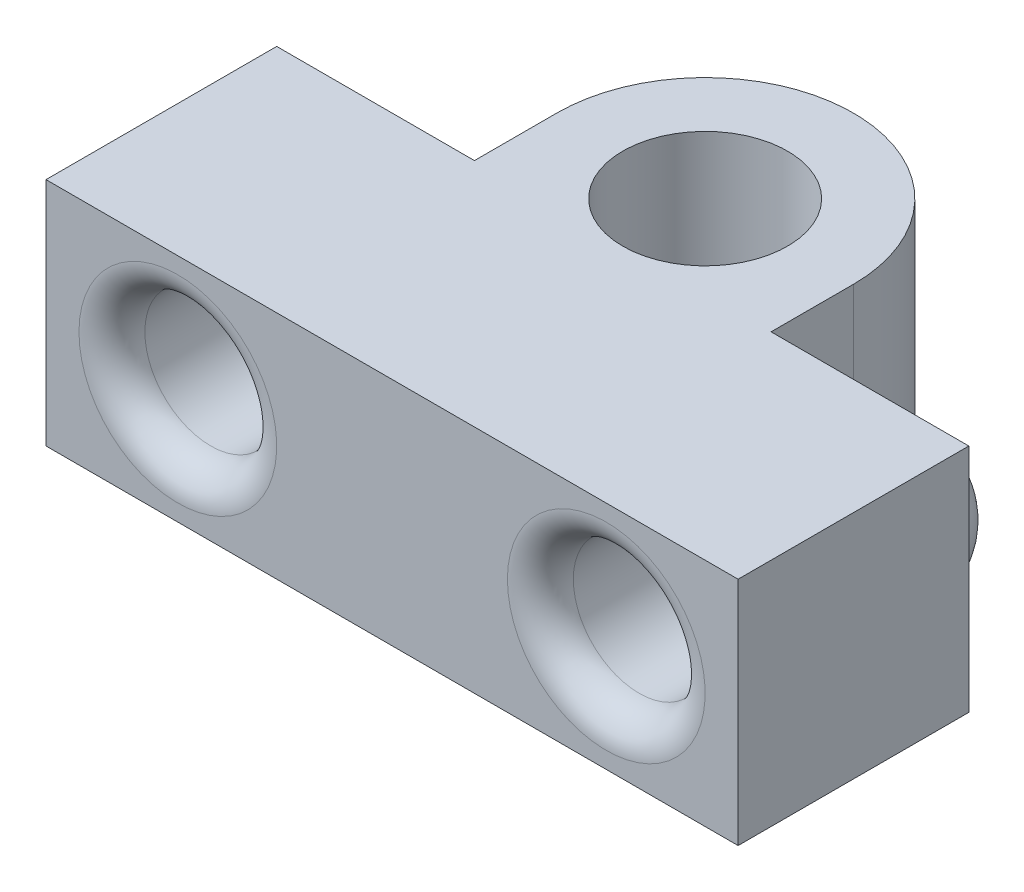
from build123d import *

# Parameters (mm, degrees)
AUFSATZ_LINEAR_AUSTRAGEN1_DEPTH = 7
SKIZZE3_R                       = 2
SCHNITT_LINEAR_AUSTRAGEN1_DEPTH = 6.7
VERRUNDUNG1_R                   = 1
SKIZZE4_R                       = 2.25
AUFSATZ_LINEAR_AUSTRAGEN2_DEPTH = 0.1
KUPPEL1_FACE_RADIUS             = 2.25
KUPPEL1_HEIGHT                  = 2.25
KUPPEL2_FACE_RADIUS             = 2.25
KUPPEL2_HEIGHT                  = 2.25


with BuildPart() as part:
    # Skizze1 → Aufsatz-Linear austragen1 (new body)
    with BuildSketch(Plane(origin=(0, 0, 0), x_dir=(1, 0, 0), z_dir=(0, 1, 0))):
        with BuildLine():
            ThreePointArc((-4.5, 2.5), (-4.30624304, 1.19375696), (-3.741657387, 0))
            Line((-3.741657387, 0), (-1e-09, 0))
            ThreePointArc((-1e-09, 0), (-2.5, 2.500000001), (0, 5))
            Line((0, 5), (0, 7))
            ThreePointArc((0, 7), (-3.181980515, 5.681980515), (-4.5, 2.5))
        make_face()
        with BuildLine():
            ThreePointArc((2.5, 2.5), (1.767766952, 0.732233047), (-1e-09, 0))
            Line((-1e-09, 0), (3.741657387, 0))
            ThreePointArc((3.741657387, 0), (4.30624304, 1.19375696), (4.5, 2.5))
            ThreePointArc((4.5, 2.5), (3.181980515, 5.681980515), (0, 7))
            Line((0, 7), (0, 5))
            ThreePointArc((0, 5), (1.767766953, 4.267766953), (2.5, 2.5))
        make_face()
        with BuildLine():
            ThreePointArc((-4.5, 2.5), (-4.30624304, 1.19375696), (-3.741657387, 0))
            Line((-3.741657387, 0), (-1e-09, 0))
            ThreePointArc((-1e-09, 0), (-2.5, 2.500000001), (0, 5))
            Line((0, 5), (0, 7))
            ThreePointArc((0, 7), (-3.181980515, 5.681980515), (-4.5, 2.5))
        make_face()
        with BuildLine():
            ThreePointArc((2.5, 2.5), (1.767766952, 0.732233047), (-1e-09, 0))
            Line((-1e-09, 0), (3.741657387, 0))
            ThreePointArc((3.741657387, 0), (4.30624304, 1.19375696), (4.5, 2.5))
            ThreePointArc((4.5, 2.5), (3.181980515, 5.681980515), (0, 7))
            Line((0, 7), (0, 5))
            ThreePointArc((0, 5), (1.767766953, 4.267766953), (2.5, 2.5))
        make_face()
        with BuildLine():
            Line((-4.5, 2.5), (-4.5, 0))
            Line((-4.5, 0), (-3.741657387, 0))
            ThreePointArc((-3.741657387, 0), (-4.30624304, 1.19375696), (-4.5, 2.5))
        make_face()
        with BuildLine():
            ThreePointArc((4.5, 2.5), (4.30624304, 1.19375696), (3.741657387, 0))
            Line((3.741657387, 0), (4.5, 0))
            Line((4.5, 0), (4.5, 2.5))
        make_face()
        with BuildLine():
            Line((-1e-09, 0), (-3.741657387, 0))
            ThreePointArc((-3.741657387, 0), (-2.121320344, -1.468626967), (0, -2))
            Line((0, -2), (0, 0))
        make_face()
        with BuildLine():
            Line((3.741657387, 0), (-1e-09, 0))
            Line((0, 0), (0, -2))
            ThreePointArc((0, -2), (2.121320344, -1.468626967), (3.741657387, 0))
        make_face()
        with BuildLine():
            Line((-1e-09, 0), (-3.741657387, 0))
            ThreePointArc((-3.741657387, 0), (-2.121320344, -1.468626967), (0, -2))
            Line((0, -2), (0, 0))
        make_face()
        with BuildLine():
            Line((3.741657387, 0), (-1e-09, 0))
            Line((0, 0), (0, -2))
            ThreePointArc((0, -2), (2.121320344, -1.468626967), (3.741657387, 0))
        make_face()
        with BuildLine():
            Line((-4.5, 0), (-10.5, 0))
            Line((-10.5, 0), (-10.5, -7))
            Line((-10.5, -7), (0, -7))
            Line((0, -7), (0, -2))
            ThreePointArc((0, -2), (-2.121320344, -1.468626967), (-3.741657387, 0))
            Line((-3.741657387, 0), (-4.5, 0))
        make_face()
        with BuildLine():
            Line((0, -2), (0, -7))
            Line((0, -7), (10.5, -7))
            Line((10.5, -7), (10.5, 0))
            Line((10.5, 0), (4.5, 0))
            Line((4.5, 0), (3.741657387, 0))
            ThreePointArc((3.741657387, 0), (2.121320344, -1.468626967), (0, -2))
        make_face()
    extrude(amount=AUFSATZ_LINEAR_AUSTRAGEN1_DEPTH)

    # Skizze3 → Schnitt-Linear austragen1 (cut)
    with BuildSketch(Plane.XY.offset(7)):
        with Locations((-6.5, 3.5)):
            Circle(SKIZZE3_R)
        with Locations((6.5, 3.5)):
            Circle(SKIZZE3_R)
    extrude(amount=-SCHNITT_LINEAR_AUSTRAGEN1_DEPTH, mode=Mode.SUBTRACT)

    # Verrundung1
    verrundung1_edges = [part.edges().sort_by_distance(p)[0] for p in [
        (-8.5, 3.5, 7),
        (4.5, 3.5, 7),
    ]]
    fillet(verrundung1_edges, radius=VERRUNDUNG1_R)

    # Skizze4 → Aufsatz-Linear austragen2 (add)
    with BuildSketch(Plane(origin=(0, 0, 0), x_dir=(-1, 0, 0), z_dir=(0, 0, -1))):
        with Locations((7.5, 3.5)):
            Circle(SKIZZE4_R)
        with Locations((-7.5, 3.5)):
            Circle(SKIZZE4_R)
    extrude(amount=AUFSATZ_LINEAR_AUSTRAGEN2_DEPTH)

    # Kuppel1: a dome of height H over a round flat face of radius A is a cap of a sphere of radius (A * A + H * H) / (2 * H)
    kuppel1_r = (KUPPEL1_FACE_RADIUS * KUPPEL1_FACE_RADIUS + KUPPEL1_HEIGHT * KUPPEL1_HEIGHT) / (2 * KUPPEL1_HEIGHT)
    kuppel1_base = Plane((7.5, 3.5, -0.1), z_dir=(0, 0, -1))
    with Locations(kuppel1_base.offset(KUPPEL1_HEIGHT - kuppel1_r)):
        kuppel1_ball = Sphere(kuppel1_r, mode=Mode.PRIVATE)
    add(split(kuppel1_ball, bisect_by=kuppel1_base, keep=Keep.TOP, mode=Mode.PRIVATE))

    # Kuppel2: a dome of height H over a round flat face of radius A is a cap of a sphere of radius (A * A + H * H) / (2 * H)
    kuppel2_r = (KUPPEL2_FACE_RADIUS * KUPPEL2_FACE_RADIUS + KUPPEL2_HEIGHT * KUPPEL2_HEIGHT) / (2 * KUPPEL2_HEIGHT)
    kuppel2_base = Plane((-7.5, 3.5, -0.1), z_dir=(0, 0, -1))
    with Locations(kuppel2_base.offset(KUPPEL2_HEIGHT - kuppel2_r)):
        kuppel2_ball = Sphere(kuppel2_r, mode=Mode.PRIVATE)
    add(split(kuppel2_ball, bisect_by=kuppel2_base, keep=Keep.TOP, mode=Mode.PRIVATE))


solid = part.part
